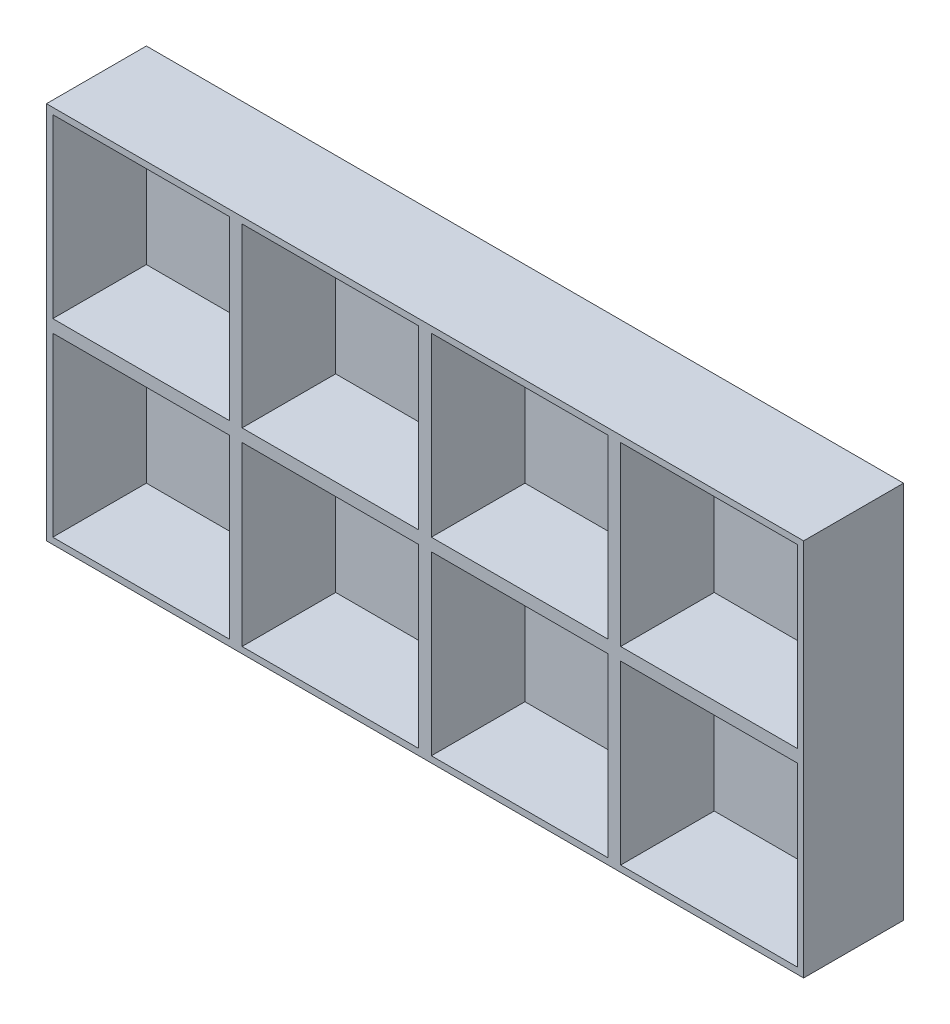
ISO-10303-21;
HEADER;
FILE_DESCRIPTION(('STEP AP214'),'2;1');
FILE_NAME('part.step','',(''),(''),'','','');
FILE_SCHEMA(('AUTOMOTIVE_DESIGN { 1 0 10303 214 1 1 1 1 }'));
ENDSEC;
DATA;
#1=APPLICATION_CONTEXT('core data for automotive mechanical design processes');
#2=APPLICATION_PROTOCOL_DEFINITION('international standard','automotive_design',2000,#1);
#3=PRODUCT_CONTEXT('',#1,'mechanical');
#4=PRODUCT('Part','Part','',(#3));
#5=PRODUCT_RELATED_PRODUCT_CATEGORY('part','',(#4));
#6=PRODUCT_DEFINITION_FORMATION('','',#4);
#7=PRODUCT_DEFINITION_CONTEXT('part definition',#1,'design');
#8=PRODUCT_DEFINITION('design','',#6,#7);
#9=PRODUCT_DEFINITION_SHAPE('','',#8);
#10=(LENGTH_UNIT() NAMED_UNIT(*) SI_UNIT(.MILLI.,.METRE.));
#11=(NAMED_UNIT(*) PLANE_ANGLE_UNIT() SI_UNIT($,.RADIAN.));
#12=(NAMED_UNIT(*) SI_UNIT($,.STERADIAN.) SOLID_ANGLE_UNIT());
#13=UNCERTAINTY_MEASURE_WITH_UNIT(LENGTH_MEASURE(1.E-05),#10,'distance_accuracy_value','');
#14=(GEOMETRIC_REPRESENTATION_CONTEXT(3) GLOBAL_UNCERTAINTY_ASSIGNED_CONTEXT((#13)) GLOBAL_UNIT_ASSIGNED_CONTEXT((#10,
#11,#12)) REPRESENTATION_CONTEXT('',''));
#15=CARTESIAN_POINT('',(0.,0.,0.));
#16=DIRECTION('',(0.,0.,1.));
#17=DIRECTION('',(1.,0.,0.));
#18=AXIS2_PLACEMENT_3D('',#15,#16,#17);
#19=CARTESIAN_POINT('',(0.,0.,14.8333333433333));
#20=DIRECTION('',(-1.,0.,0.));
#21=DIRECTION('',(0.,0.,1.));
#22=AXIS2_PLACEMENT_3D('',#19,#20,#21);
#23=PLANE('',#22);
#24=DIRECTION('',(0.,0.,-1.));
#25=VECTOR('',#24,1.);
#26=CARTESIAN_POINT('',(0.,30.,14.8333333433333));
#27=LINE('',#26,#25);
#28=CARTESIAN_POINT('',(0.,30.,14.8333333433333));
#29=VERTEX_POINT('',#28);
#30=CARTESIAN_POINT('',(0.,30.,-1.));
#31=VERTEX_POINT('',#30);
#32=EDGE_CURVE('E61',#29,#31,#27,.T.);
#33=ORIENTED_EDGE('',*,*,#32,.T.);
#34=DIRECTION('',(0.,1.,0.));
#35=VECTOR('',#34,1.);
#36=CARTESIAN_POINT('',(0.,30.,-1.));
#37=LINE('',#36,#35);
#38=CARTESIAN_POINT('',(0.,-30.,-1.));
#39=VERTEX_POINT('',#38);
#40=EDGE_CURVE('E982',#39,#31,#37,.T.);
#41=ORIENTED_EDGE('',*,*,#40,.F.);
#42=DIRECTION('',(0.,0.,-1.));
#43=VECTOR('',#42,1.);
#44=CARTESIAN_POINT('',(0.,-30.,14.8333333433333));
#45=LINE('',#44,#43);
#46=CARTESIAN_POINT('',(0.,-30.,14.8333333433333));
#47=VERTEX_POINT('',#46);
#48=EDGE_CURVE('E201',#47,#39,#45,.T.);
#49=ORIENTED_EDGE('',*,*,#48,.F.);
#50=DIRECTION('',(0.,1.,0.));
#51=VECTOR('',#50,1.);
#52=CARTESIAN_POINT('',(0.,0.,14.8333333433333));
#53=LINE('',#52,#51);
#54=EDGE_CURVE('E186',#47,#29,#53,.T.);
#55=ORIENTED_EDGE('',*,*,#54,.T.);
#56=EDGE_LOOP('',(#33,#41,#49,#55));
#57=FACE_BOUND('',#56,.T.);
#58=ADVANCED_FACE('F51',(#57),#23,.T.);
#59=CARTESIAN_POINT('',(120.,0.,14.8333333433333));
#60=DIRECTION('',(-1.,0.,0.));
#61=DIRECTION('',(0.,-1.,0.));
#62=AXIS2_PLACEMENT_3D('',#59,#60,#61);
#63=PLANE('',#62);
#64=DIRECTION('',(0.,0.,-1.));
#65=VECTOR('',#64,1.);
#66=CARTESIAN_POINT('',(120.,-30.,14.8333333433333));
#67=LINE('',#66,#65);
#68=CARTESIAN_POINT('',(120.,-30.,14.8333333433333));
#69=VERTEX_POINT('',#68);
#70=CARTESIAN_POINT('',(120.,-30.,-1.));
#71=VERTEX_POINT('',#70);
#72=EDGE_CURVE('E705',#69,#71,#67,.T.);
#73=ORIENTED_EDGE('',*,*,#72,.T.);
#74=DIRECTION('',(0.,-1.,0.));
#75=VECTOR('',#74,1.);
#76=CARTESIAN_POINT('',(120.,30.,-1.));
#77=LINE('',#76,#75);
#78=CARTESIAN_POINT('',(120.,30.,-1.));
#79=VERTEX_POINT('',#78);
#80=EDGE_CURVE('E983',#79,#71,#77,.T.);
#81=ORIENTED_EDGE('',*,*,#80,.F.);
#82=DIRECTION('',(0.,0.,-1.));
#83=VECTOR('',#82,1.);
#84=CARTESIAN_POINT('',(120.,30.,14.8333333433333));
#85=LINE('',#84,#83);
#86=CARTESIAN_POINT('',(120.,30.,14.8333333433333));
#87=VERTEX_POINT('',#86);
#88=EDGE_CURVE('E11',#87,#79,#85,.T.);
#89=ORIENTED_EDGE('',*,*,#88,.F.);
#90=DIRECTION('',(0.,1.,0.));
#91=VECTOR('',#90,1.);
#92=CARTESIAN_POINT('',(120.,0.,14.8333333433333));
#93=LINE('',#92,#91);
#94=EDGE_CURVE('E188',#69,#87,#93,.T.);
#95=ORIENTED_EDGE('',*,*,#94,.F.);
#96=EDGE_LOOP('',(#73,#81,#89,#95));
#97=FACE_BOUND('',#96,.T.);
#98=ADVANCED_FACE('F345',(#97),#63,.F.);
#99=CARTESIAN_POINT('',(0.,1.,14.8333333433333));
#100=DIRECTION('',(0.,1.,0.));
#101=DIRECTION('',(0.,0.,1.));
#102=AXIS2_PLACEMENT_3D('',#99,#100,#101);
#103=PLANE('',#102);
#104=DIRECTION('',(1.,0.,0.));
#105=VECTOR('',#104,1.);
#106=CARTESIAN_POINT('',(0.,1.,0.));
#107=LINE('',#106,#105);
#108=CARTESIAN_POINT('',(1.,1.,0.));
#109=VERTEX_POINT('',#108);
#110=CARTESIAN_POINT('',(29.,1.,0.));
#111=VERTEX_POINT('',#110);
#112=EDGE_CURVE('E232',#109,#111,#107,.T.);
#113=ORIENTED_EDGE('',*,*,#112,.F.);
#114=DIRECTION('',(0.,0.,-1.));
#115=VECTOR('',#114,1.);
#116=CARTESIAN_POINT('',(1.,1.,14.8333333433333));
#117=LINE('',#116,#115);
#118=CARTESIAN_POINT('',(1.,1.,14.8333333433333));
#119=VERTEX_POINT('',#118);
#120=EDGE_CURVE('E175',#119,#109,#117,.T.);
#121=ORIENTED_EDGE('',*,*,#120,.F.);
#122=DIRECTION('',(1.,0.,0.));
#123=VECTOR('',#122,1.);
#124=CARTESIAN_POINT('',(0.,1.,14.8333333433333));
#125=LINE('',#124,#123);
#126=CARTESIAN_POINT('',(29.,1.,14.8333333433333));
#127=VERTEX_POINT('',#126);
#128=EDGE_CURVE('E173',#119,#127,#125,.T.);
#129=ORIENTED_EDGE('',*,*,#128,.T.);
#130=DIRECTION('',(0.,0.,-1.));
#131=VECTOR('',#130,1.);
#132=CARTESIAN_POINT('',(29.,1.,14.8333333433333));
#133=LINE('',#132,#131);
#134=EDGE_CURVE('E108',#127,#111,#133,.T.);
#135=ORIENTED_EDGE('',*,*,#134,.T.);
#136=EDGE_LOOP('',(#113,#121,#129,#135));
#137=FACE_BOUND('',#136,.T.);
#138=ADVANCED_FACE('F174',(#137),#103,.T.);
#139=CARTESIAN_POINT('',(1.,0.,14.8333333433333));
#140=DIRECTION('',(1.,0.,0.));
#141=DIRECTION('',(0.,1.,0.));
#142=AXIS2_PLACEMENT_3D('',#139,#140,#141);
#143=PLANE('',#142);
#144=DIRECTION('',(0.,-1.,0.));
#145=VECTOR('',#144,1.);
#146=CARTESIAN_POINT('',(1.,0.,0.));
#147=LINE('',#146,#145);
#148=CARTESIAN_POINT('',(1.,29.,0.));
#149=VERTEX_POINT('',#148);
#150=EDGE_CURVE('E234',#149,#109,#147,.T.);
#151=ORIENTED_EDGE('',*,*,#150,.F.);
#152=DIRECTION('',(0.,0.,-1.));
#153=VECTOR('',#152,1.);
#154=CARTESIAN_POINT('',(1.,29.,14.8333333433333));
#155=LINE('',#154,#153);
#156=CARTESIAN_POINT('',(1.,29.,14.8333333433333));
#157=VERTEX_POINT('',#156);
#158=EDGE_CURVE('E100',#157,#149,#155,.T.);
#159=ORIENTED_EDGE('',*,*,#158,.F.);
#160=DIRECTION('',(0.,-1.,0.));
#161=VECTOR('',#160,1.);
#162=CARTESIAN_POINT('',(1.,0.,14.8333333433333));
#163=LINE('',#162,#161);
#164=EDGE_CURVE('E179',#157,#119,#163,.T.);
#165=ORIENTED_EDGE('',*,*,#164,.T.);
#166=ORIENTED_EDGE('',*,*,#120,.T.);
#167=EDGE_LOOP('',(#151,#159,#165,#166));
#168=FACE_BOUND('',#167,.T.);
#169=ADVANCED_FACE('F323',(#168),#143,.T.);
#170=CARTESIAN_POINT('',(0.,29.,14.8333333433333));
#171=DIRECTION('',(0.,-1.,0.));
#172=DIRECTION('',(1.,0.,0.));
#173=AXIS2_PLACEMENT_3D('',#170,#171,#172);
#174=PLANE('',#173);
#175=DIRECTION('',(-1.,0.,0.));
#176=VECTOR('',#175,1.);
#177=CARTESIAN_POINT('',(0.,29.,0.));
#178=LINE('',#177,#176);
#179=CARTESIAN_POINT('',(29.,29.,0.));
#180=VERTEX_POINT('',#179);
#181=EDGE_CURVE('E237',#180,#149,#178,.T.);
#182=ORIENTED_EDGE('',*,*,#181,.F.);
#183=DIRECTION('',(0.,0.,-1.));
#184=VECTOR('',#183,1.);
#185=CARTESIAN_POINT('',(29.,29.,14.8333333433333));
#186=LINE('',#185,#184);
#187=CARTESIAN_POINT('',(29.,29.,14.8333333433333));
#188=VERTEX_POINT('',#187);
#189=EDGE_CURVE('E169',#188,#180,#186,.T.);
#190=ORIENTED_EDGE('',*,*,#189,.F.);
#191=DIRECTION('',(-1.,0.,0.));
#192=VECTOR('',#191,1.);
#193=CARTESIAN_POINT('',(0.,29.,14.8333333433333));
#194=LINE('',#193,#192);
#195=EDGE_CURVE('E185',#188,#157,#194,.T.);
#196=ORIENTED_EDGE('',*,*,#195,.T.);
#197=ORIENTED_EDGE('',*,*,#158,.T.);
#198=EDGE_LOOP('',(#182,#190,#196,#197));
#199=FACE_BOUND('',#198,.T.);
#200=ADVANCED_FACE('F324',(#199),#174,.T.);
#201=CARTESIAN_POINT('',(0.,0.999999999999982,14.8333333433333));
#202=DIRECTION('',(0.,1.,0.));
#203=DIRECTION('',(-1.,0.,0.));
#204=AXIS2_PLACEMENT_3D('',#201,#202,#203);
#205=PLANE('',#204);
#206=DIRECTION('',(1.,0.,0.));
#207=VECTOR('',#206,1.);
#208=CARTESIAN_POINT('',(0.,0.999999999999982,0.));
#209=LINE('',#208,#207);
#210=CARTESIAN_POINT('',(91.,1.00000000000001,0.));
#211=VERTEX_POINT('',#210);
#212=CARTESIAN_POINT('',(119.,1.00000000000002,0.));
#213=VERTEX_POINT('',#212);
#214=EDGE_CURVE('E221',#211,#213,#209,.T.);
#215=ORIENTED_EDGE('',*,*,#214,.F.);
#216=DIRECTION('',(0.,0.,-1.));
#217=VECTOR('',#216,1.);
#218=CARTESIAN_POINT('',(91.,1.00000000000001,14.8333333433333));
#219=LINE('',#218,#217);
#220=CARTESIAN_POINT('',(91.,1.00000000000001,14.8333333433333));
#221=VERTEX_POINT('',#220);
#222=EDGE_CURVE('E170',#221,#211,#219,.T.);
#223=ORIENTED_EDGE('',*,*,#222,.F.);
#224=DIRECTION('',(1.,0.,0.));
#225=VECTOR('',#224,1.);
#226=CARTESIAN_POINT('',(0.,0.999999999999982,14.8333333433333));
#227=LINE('',#226,#225);
#228=CARTESIAN_POINT('',(119.,1.00000000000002,14.8333333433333));
#229=VERTEX_POINT('',#228);
#230=EDGE_CURVE('E313',#221,#229,#227,.T.);
#231=ORIENTED_EDGE('',*,*,#230,.T.);
#232=DIRECTION('',(0.,0.,-1.));
#233=VECTOR('',#232,1.);
#234=CARTESIAN_POINT('',(119.,1.00000000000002,14.8333333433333));
#235=LINE('',#234,#233);
#236=EDGE_CURVE('E246',#229,#213,#235,.T.);
#237=ORIENTED_EDGE('',*,*,#236,.T.);
#238=EDGE_LOOP('',(#215,#223,#231,#237));
#239=FACE_BOUND('',#238,.T.);
#240=ADVANCED_FACE('F361',(#239),#205,.T.);
#241=CARTESIAN_POINT('',(91.,0.,14.8333333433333));
#242=DIRECTION('',(-1.,0.,0.));
#243=DIRECTION('',(0.,0.,1.));
#244=AXIS2_PLACEMENT_3D('',#241,#242,#243);
#245=PLANE('',#244);
#246=DIRECTION('',(0.,1.,0.));
#247=VECTOR('',#246,1.);
#248=CARTESIAN_POINT('',(91.,0.,0.));
#249=LINE('',#248,#247);
#250=CARTESIAN_POINT('',(91.,29.,0.));
#251=VERTEX_POINT('',#250);
#252=EDGE_CURVE('E223',#211,#251,#249,.T.);
#253=ORIENTED_EDGE('',*,*,#252,.T.);
#254=DIRECTION('',(0.,0.,-1.));
#255=VECTOR('',#254,1.);
#256=CARTESIAN_POINT('',(91.,29.,14.8333333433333));
#257=LINE('',#256,#255);
#258=CARTESIAN_POINT('',(91.,29.,14.8333333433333));
#259=VERTEX_POINT('',#258);
#260=EDGE_CURVE('E253',#259,#251,#257,.T.);
#261=ORIENTED_EDGE('',*,*,#260,.F.);
#262=DIRECTION('',(0.,1.,0.));
#263=VECTOR('',#262,1.);
#264=CARTESIAN_POINT('',(91.,0.,14.8333333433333));
#265=LINE('',#264,#263);
#266=EDGE_CURVE('E316',#221,#259,#265,.T.);
#267=ORIENTED_EDGE('',*,*,#266,.F.);
#268=ORIENTED_EDGE('',*,*,#222,.T.);
#269=EDGE_LOOP('',(#253,#261,#267,#268));
#270=FACE_BOUND('',#269,.T.);
#271=ADVANCED_FACE('F374',(#270),#245,.F.);
#272=CARTESIAN_POINT('',(0.,29.,14.8333333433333));
#273=DIRECTION('',(0.,1.,0.));
#274=DIRECTION('',(-1.,0.,0.));
#275=AXIS2_PLACEMENT_3D('',#272,#273,#274);
#276=PLANE('',#275);
#277=DIRECTION('',(1.,0.,0.));
#278=VECTOR('',#277,1.);
#279=CARTESIAN_POINT('',(0.,29.,0.));
#280=LINE('',#279,#278);
#281=CARTESIAN_POINT('',(119.,29.,0.));
#282=VERTEX_POINT('',#281);
#283=EDGE_CURVE('E226',#251,#282,#280,.T.);
#284=ORIENTED_EDGE('',*,*,#283,.T.);
#285=DIRECTION('',(0.,0.,-1.));
#286=VECTOR('',#285,1.);
#287=CARTESIAN_POINT('',(119.,29.,14.8333333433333));
#288=LINE('',#287,#286);
#289=CARTESIAN_POINT('',(119.,29.,14.8333333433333));
#290=VERTEX_POINT('',#289);
#291=EDGE_CURVE('E249',#290,#282,#288,.T.);
#292=ORIENTED_EDGE('',*,*,#291,.F.);
#293=DIRECTION('',(1.,0.,0.));
#294=VECTOR('',#293,1.);
#295=CARTESIAN_POINT('',(0.,29.,14.8333333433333));
#296=LINE('',#295,#294);
#297=EDGE_CURVE('E319',#259,#290,#296,.T.);
#298=ORIENTED_EDGE('',*,*,#297,.F.);
#299=ORIENTED_EDGE('',*,*,#260,.T.);
#300=EDGE_LOOP('',(#284,#292,#298,#299));
#301=FACE_BOUND('',#300,.T.);
#302=ADVANCED_FACE('F370',(#301),#276,.F.);
#303=CARTESIAN_POINT('',(0.,0.999999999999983,14.8333333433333));
#304=DIRECTION('',(0.,1.,0.));
#305=DIRECTION('',(-1.,0.,0.));
#306=AXIS2_PLACEMENT_3D('',#303,#304,#305);
#307=PLANE('',#306);
#308=DIRECTION('',(1.,0.,0.));
#309=VECTOR('',#308,1.);
#310=CARTESIAN_POINT('',(0.,0.999999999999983,0.));
#311=LINE('',#310,#309);
#312=CARTESIAN_POINT('',(61.,1.,0.));
#313=VERTEX_POINT('',#312);
#314=CARTESIAN_POINT('',(89.,1.00000000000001,0.));
#315=VERTEX_POINT('',#314);
#316=EDGE_CURVE('E210',#313,#315,#311,.T.);
#317=ORIENTED_EDGE('',*,*,#316,.F.);
#318=DIRECTION('',(0.,0.,-1.));
#319=VECTOR('',#318,1.);
#320=CARTESIAN_POINT('',(61.,1.,14.8333333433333));
#321=LINE('',#320,#319);
#322=CARTESIAN_POINT('',(61.,1.,14.8333333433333));
#323=VERTEX_POINT('',#322);
#324=EDGE_CURVE('E250',#323,#313,#321,.T.);
#325=ORIENTED_EDGE('',*,*,#324,.F.);
#326=DIRECTION('',(1.,0.,0.));
#327=VECTOR('',#326,1.);
#328=CARTESIAN_POINT('',(0.,0.999999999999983,14.8333333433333));
#329=LINE('',#328,#327);
#330=CARTESIAN_POINT('',(89.,1.00000000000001,14.8333333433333));
#331=VERTEX_POINT('',#330);
#332=EDGE_CURVE('E297',#323,#331,#329,.T.);
#333=ORIENTED_EDGE('',*,*,#332,.T.);
#334=DIRECTION('',(0.,0.,-1.));
#335=VECTOR('',#334,1.);
#336=CARTESIAN_POINT('',(89.,1.00000000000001,14.8333333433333));
#337=LINE('',#336,#335);
#338=EDGE_CURVE('E258',#331,#315,#337,.T.);
#339=ORIENTED_EDGE('',*,*,#338,.T.);
#340=EDGE_LOOP('',(#317,#325,#333,#339));
#341=FACE_BOUND('',#340,.T.);
#342=ADVANCED_FACE('F373',(#341),#307,.T.);
#343=CARTESIAN_POINT('',(61.,0.,14.8333333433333));
#344=DIRECTION('',(-1.,0.,0.));
#345=DIRECTION('',(0.,-1.,0.));
#346=AXIS2_PLACEMENT_3D('',#343,#344,#345);
#347=PLANE('',#346);
#348=DIRECTION('',(0.,1.,0.));
#349=VECTOR('',#348,1.);
#350=CARTESIAN_POINT('',(61.,0.,0.));
#351=LINE('',#350,#349);
#352=CARTESIAN_POINT('',(61.,29.,0.));
#353=VERTEX_POINT('',#352);
#354=EDGE_CURVE('E212',#313,#353,#351,.T.);
#355=ORIENTED_EDGE('',*,*,#354,.T.);
#356=DIRECTION('',(0.,0.,-1.));
#357=VECTOR('',#356,1.);
#358=CARTESIAN_POINT('',(61.,29.,14.8333333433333));
#359=LINE('',#358,#357);
#360=CARTESIAN_POINT('',(61.,29.,14.8333333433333));
#361=VERTEX_POINT('',#360);
#362=EDGE_CURVE('E264',#361,#353,#359,.T.);
#363=ORIENTED_EDGE('',*,*,#362,.F.);
#364=DIRECTION('',(0.,1.,0.));
#365=VECTOR('',#364,1.);
#366=CARTESIAN_POINT('',(61.,0.,14.8333333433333));
#367=LINE('',#366,#365);
#368=EDGE_CURVE('E301',#323,#361,#367,.T.);
#369=ORIENTED_EDGE('',*,*,#368,.F.);
#370=ORIENTED_EDGE('',*,*,#324,.T.);
#371=EDGE_LOOP('',(#355,#363,#369,#370));
#372=FACE_BOUND('',#371,.T.);
#373=ADVANCED_FACE('F388',(#372),#347,.F.);
#374=CARTESIAN_POINT('',(0.,29.,14.8333333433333));
#375=DIRECTION('',(0.,1.,0.));
#376=DIRECTION('',(0.,0.,1.));
#377=AXIS2_PLACEMENT_3D('',#374,#375,#376);
#378=PLANE('',#377);
#379=DIRECTION('',(1.,0.,0.));
#380=VECTOR('',#379,1.);
#381=CARTESIAN_POINT('',(0.,29.,0.));
#382=LINE('',#381,#380);
#383=CARTESIAN_POINT('',(89.,29.,0.));
#384=VERTEX_POINT('',#383);
#385=EDGE_CURVE('E215',#353,#384,#382,.T.);
#386=ORIENTED_EDGE('',*,*,#385,.T.);
#387=DIRECTION('',(0.,0.,-1.));
#388=VECTOR('',#387,1.);
#389=CARTESIAN_POINT('',(89.,29.,14.8333333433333));
#390=LINE('',#389,#388);
#391=CARTESIAN_POINT('',(89.,29.,14.8333333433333));
#392=VERTEX_POINT('',#391);
#393=EDGE_CURVE('E261',#392,#384,#390,.T.);
#394=ORIENTED_EDGE('',*,*,#393,.F.);
#395=DIRECTION('',(1.,0.,0.));
#396=VECTOR('',#395,1.);
#397=CARTESIAN_POINT('',(0.,29.,14.8333333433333));
#398=LINE('',#397,#396);
#399=EDGE_CURVE('E308',#361,#392,#398,.T.);
#400=ORIENTED_EDGE('',*,*,#399,.F.);
#401=ORIENTED_EDGE('',*,*,#362,.T.);
#402=EDGE_LOOP('',(#386,#394,#400,#401));
#403=FACE_BOUND('',#402,.T.);
#404=ADVANCED_FACE('F385',(#403),#378,.F.);
#405=CARTESIAN_POINT('',(0.,1.,14.8333333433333));
#406=DIRECTION('',(0.,1.,0.));
#407=DIRECTION('',(-1.,0.,0.));
#408=AXIS2_PLACEMENT_3D('',#405,#406,#407);
#409=PLANE('',#408);
#410=DIRECTION('',(1.,0.,0.));
#411=VECTOR('',#410,1.);
#412=CARTESIAN_POINT('',(0.,1.,0.));
#413=LINE('',#412,#411);
#414=CARTESIAN_POINT('',(31.,1.,0.));
#415=VERTEX_POINT('',#414);
#416=CARTESIAN_POINT('',(59.,1.,0.));
#417=VERTEX_POINT('',#416);
#418=EDGE_CURVE('E197',#415,#417,#413,.T.);
#419=ORIENTED_EDGE('',*,*,#418,.F.);
#420=DIRECTION('',(0.,0.,-1.));
#421=VECTOR('',#420,1.);
#422=CARTESIAN_POINT('',(31.,1.,14.8333333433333));
#423=LINE('',#422,#421);
#424=CARTESIAN_POINT('',(31.,1.,14.8333333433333));
#425=VERTEX_POINT('',#424);
#426=EDGE_CURVE('E55',#425,#415,#423,.T.);
#427=ORIENTED_EDGE('',*,*,#426,.F.);
#428=DIRECTION('',(1.,0.,0.));
#429=VECTOR('',#428,1.);
#430=CARTESIAN_POINT('',(0.,1.,14.8333333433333));
#431=LINE('',#430,#429);
#432=CARTESIAN_POINT('',(59.,1.,14.8333333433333));
#433=VERTEX_POINT('',#432);
#434=EDGE_CURVE('E241',#425,#433,#431,.T.);
#435=ORIENTED_EDGE('',*,*,#434,.T.);
#436=DIRECTION('',(0.,0.,-1.));
#437=VECTOR('',#436,1.);
#438=CARTESIAN_POINT('',(59.,1.,14.8333333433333));
#439=LINE('',#438,#437);
#440=EDGE_CURVE('E196',#433,#417,#439,.T.);
#441=ORIENTED_EDGE('',*,*,#440,.T.);
#442=EDGE_LOOP('',(#419,#427,#435,#441));
#443=FACE_BOUND('',#442,.T.);
#444=ADVANCED_FACE('F53',(#443),#409,.T.);
#445=CARTESIAN_POINT('',(31.,0.,14.8333333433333));
#446=DIRECTION('',(1.,0.,0.));
#447=DIRECTION('',(0.,1.,0.));
#448=AXIS2_PLACEMENT_3D('',#445,#446,#447);
#449=PLANE('',#448);
#450=DIRECTION('',(0.,-1.,0.));
#451=VECTOR('',#450,1.);
#452=CARTESIAN_POINT('',(31.,0.,0.));
#453=LINE('',#452,#451);
#454=CARTESIAN_POINT('',(31.,29.,0.));
#455=VERTEX_POINT('',#454);
#456=EDGE_CURVE('E200',#455,#415,#453,.T.);
#457=ORIENTED_EDGE('',*,*,#456,.F.);
#458=DIRECTION('',(0.,0.,-1.));
#459=VECTOR('',#458,1.);
#460=CARTESIAN_POINT('',(31.,29.,14.8333333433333));
#461=LINE('',#460,#459);
#462=CARTESIAN_POINT('',(31.,29.,14.8333333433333));
#463=VERTEX_POINT('',#462);
#464=EDGE_CURVE('E272',#463,#455,#461,.T.);
#465=ORIENTED_EDGE('',*,*,#464,.F.);
#466=DIRECTION('',(0.,-1.,0.));
#467=VECTOR('',#466,1.);
#468=CARTESIAN_POINT('',(31.,0.,14.8333333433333));
#469=LINE('',#468,#467);
#470=EDGE_CURVE('E281',#463,#425,#469,.T.);
#471=ORIENTED_EDGE('',*,*,#470,.T.);
#472=ORIENTED_EDGE('',*,*,#426,.T.);
#473=EDGE_LOOP('',(#457,#465,#471,#472));
#474=FACE_BOUND('',#473,.T.);
#475=ADVANCED_FACE('F279',(#474),#449,.T.);
#476=CARTESIAN_POINT('',(0.,29.,14.8333333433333));
#477=DIRECTION('',(0.,-1.,0.));
#478=DIRECTION('',(1.,0.,0.));
#479=AXIS2_PLACEMENT_3D('',#476,#477,#478);
#480=PLANE('',#479);
#481=DIRECTION('',(-1.,0.,0.));
#482=VECTOR('',#481,1.);
#483=CARTESIAN_POINT('',(0.,29.,0.));
#484=LINE('',#483,#482);
#485=CARTESIAN_POINT('',(59.,29.,0.));
#486=VERTEX_POINT('',#485);
#487=EDGE_CURVE('E204',#486,#455,#484,.T.);
#488=ORIENTED_EDGE('',*,*,#487,.F.);
#489=DIRECTION('',(0.,0.,-1.));
#490=VECTOR('',#489,1.);
#491=CARTESIAN_POINT('',(59.,29.,14.8333333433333));
#492=LINE('',#491,#490);
#493=CARTESIAN_POINT('',(59.,29.,14.8333333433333));
#494=VERTEX_POINT('',#493);
#495=EDGE_CURVE('E270',#494,#486,#492,.T.);
#496=ORIENTED_EDGE('',*,*,#495,.F.);
#497=DIRECTION('',(-1.,0.,0.));
#498=VECTOR('',#497,1.);
#499=CARTESIAN_POINT('',(0.,29.,14.8333333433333));
#500=LINE('',#499,#498);
#501=EDGE_CURVE('E298',#494,#463,#500,.T.);
#502=ORIENTED_EDGE('',*,*,#501,.T.);
#503=ORIENTED_EDGE('',*,*,#464,.T.);
#504=EDGE_LOOP('',(#488,#496,#502,#503));
#505=FACE_BOUND('',#504,.T.);
#506=ADVANCED_FACE('F286',(#505),#480,.T.);
#507=CARTESIAN_POINT('',(29.,0.,14.8333333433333));
#508=DIRECTION('',(-1.,0.,0.));
#509=DIRECTION('',(0.,0.,1.));
#510=AXIS2_PLACEMENT_3D('',#507,#508,#509);
#511=PLANE('',#510);
#512=DIRECTION('',(0.,1.,0.));
#513=VECTOR('',#512,1.);
#514=CARTESIAN_POINT('',(29.,0.,0.));
#515=LINE('',#514,#513);
#516=EDGE_CURVE('E167',#111,#180,#515,.T.);
#517=ORIENTED_EDGE('',*,*,#516,.F.);
#518=ORIENTED_EDGE('',*,*,#134,.F.);
#519=DIRECTION('',(0.,1.,0.));
#520=VECTOR('',#519,1.);
#521=CARTESIAN_POINT('',(29.,0.,14.8333333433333));
#522=LINE('',#521,#520);
#523=EDGE_CURVE('E165',#127,#188,#522,.T.);
#524=ORIENTED_EDGE('',*,*,#523,.T.);
#525=ORIENTED_EDGE('',*,*,#189,.T.);
#526=EDGE_LOOP('',(#517,#518,#524,#525));
#527=FACE_BOUND('',#526,.T.);
#528=ADVANCED_FACE('F162',(#527),#511,.T.);
#529=CARTESIAN_POINT('',(119.,0.,14.8333333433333));
#530=DIRECTION('',(1.,0.,0.));
#531=DIRECTION('',(0.,1.,0.));
#532=AXIS2_PLACEMENT_3D('',#529,#530,#531);
#533=PLANE('',#532);
#534=DIRECTION('',(0.,-1.,0.));
#535=VECTOR('',#534,1.);
#536=CARTESIAN_POINT('',(119.,0.,0.));
#537=LINE('',#536,#535);
#538=EDGE_CURVE('E229',#282,#213,#537,.T.);
#539=ORIENTED_EDGE('',*,*,#538,.T.);
#540=ORIENTED_EDGE('',*,*,#236,.F.);
#541=DIRECTION('',(0.,-1.,0.));
#542=VECTOR('',#541,1.);
#543=CARTESIAN_POINT('',(119.,0.,14.8333333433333));
#544=LINE('',#543,#542);
#545=EDGE_CURVE('E180',#290,#229,#544,.T.);
#546=ORIENTED_EDGE('',*,*,#545,.F.);
#547=ORIENTED_EDGE('',*,*,#291,.T.);
#548=EDGE_LOOP('',(#539,#540,#546,#547));
#549=FACE_BOUND('',#548,.T.);
#550=ADVANCED_FACE('F358',(#549),#533,.F.);
#551=CARTESIAN_POINT('',(89.,0.,14.8333333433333));
#552=DIRECTION('',(1.,0.,0.));
#553=DIRECTION('',(0.,0.,-1.));
#554=AXIS2_PLACEMENT_3D('',#551,#552,#553);
#555=PLANE('',#554);
#556=DIRECTION('',(0.,-1.,0.));
#557=VECTOR('',#556,1.);
#558=CARTESIAN_POINT('',(89.,0.,0.));
#559=LINE('',#558,#557);
#560=EDGE_CURVE('E218',#384,#315,#559,.T.);
#561=ORIENTED_EDGE('',*,*,#560,.T.);
#562=ORIENTED_EDGE('',*,*,#338,.F.);
#563=DIRECTION('',(0.,-1.,0.));
#564=VECTOR('',#563,1.);
#565=CARTESIAN_POINT('',(89.,0.,14.8333333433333));
#566=LINE('',#565,#564);
#567=EDGE_CURVE('E311',#392,#331,#566,.T.);
#568=ORIENTED_EDGE('',*,*,#567,.F.);
#569=ORIENTED_EDGE('',*,*,#393,.T.);
#570=EDGE_LOOP('',(#561,#562,#568,#569));
#571=FACE_BOUND('',#570,.T.);
#572=ADVANCED_FACE('F368',(#571),#555,.F.);
#573=CARTESIAN_POINT('',(59.,0.,14.8333333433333));
#574=DIRECTION('',(-1.,0.,0.));
#575=DIRECTION('',(0.,0.,1.));
#576=AXIS2_PLACEMENT_3D('',#573,#574,#575);
#577=PLANE('',#576);
#578=DIRECTION('',(0.,1.,0.));
#579=VECTOR('',#578,1.);
#580=CARTESIAN_POINT('',(59.,0.,0.));
#581=LINE('',#580,#579);
#582=EDGE_CURVE('E207',#417,#486,#581,.T.);
#583=ORIENTED_EDGE('',*,*,#582,.F.);
#584=ORIENTED_EDGE('',*,*,#440,.F.);
#585=DIRECTION('',(0.,1.,0.));
#586=VECTOR('',#585,1.);
#587=CARTESIAN_POINT('',(59.,0.,14.8333333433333));
#588=LINE('',#587,#586);
#589=EDGE_CURVE('E295',#433,#494,#588,.T.);
#590=ORIENTED_EDGE('',*,*,#589,.T.);
#591=ORIENTED_EDGE('',*,*,#495,.T.);
#592=EDGE_LOOP('',(#583,#584,#590,#591));
#593=FACE_BOUND('',#592,.T.);
#594=ADVANCED_FACE('F293',(#593),#577,.T.);
#595=CARTESIAN_POINT('',(0.,30.,14.8333333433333));
#596=DIRECTION('',(0.,1.,0.));
#597=DIRECTION('',(-1.,0.,0.));
#598=AXIS2_PLACEMENT_3D('',#595,#596,#597);
#599=PLANE('',#598);
#600=ORIENTED_EDGE('',*,*,#88,.T.);
#601=DIRECTION('',(1.,0.,0.));
#602=VECTOR('',#601,1.);
#603=CARTESIAN_POINT('',(120.,30.,-1.));
#604=LINE('',#603,#602);
#605=EDGE_CURVE('E985',#31,#79,#604,.T.);
#606=ORIENTED_EDGE('',*,*,#605,.F.);
#607=ORIENTED_EDGE('',*,*,#32,.F.);
#608=DIRECTION('',(1.,0.,0.));
#609=VECTOR('',#608,1.);
#610=CARTESIAN_POINT('',(0.,30.,14.8333333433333));
#611=LINE('',#610,#609);
#612=EDGE_CURVE('E194',#29,#87,#611,.T.);
#613=ORIENTED_EDGE('',*,*,#612,.T.);
#614=EDGE_LOOP('',(#600,#606,#607,#613));
#615=FACE_BOUND('',#614,.T.);
#616=ADVANCED_FACE('F398',(#615),#599,.T.);
#617=CARTESIAN_POINT('',(0.,0.,14.8333333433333));
#618=DIRECTION('',(0.,0.,1.));
#619=DIRECTION('',(1.,0.,0.));
#620=AXIS2_PLACEMENT_3D('',#617,#618,#619);
#621=PLANE('',#620);
#622=ORIENTED_EDGE('',*,*,#434,.F.);
#623=ORIENTED_EDGE('',*,*,#470,.F.);
#624=ORIENTED_EDGE('',*,*,#501,.F.);
#625=ORIENTED_EDGE('',*,*,#589,.F.);
#626=EDGE_LOOP('',(#622,#623,#624,#625));
#627=FACE_BOUND('',#626,.T.);
#628=ORIENTED_EDGE('',*,*,#332,.F.);
#629=ORIENTED_EDGE('',*,*,#368,.T.);
#630=ORIENTED_EDGE('',*,*,#399,.T.);
#631=ORIENTED_EDGE('',*,*,#567,.T.);
#632=EDGE_LOOP('',(#628,#629,#630,#631));
#633=FACE_BOUND('',#632,.T.);
#634=ORIENTED_EDGE('',*,*,#230,.F.);
#635=ORIENTED_EDGE('',*,*,#266,.T.);
#636=ORIENTED_EDGE('',*,*,#297,.T.);
#637=ORIENTED_EDGE('',*,*,#545,.T.);
#638=EDGE_LOOP('',(#634,#635,#636,#637));
#639=FACE_BOUND('',#638,.T.);
#640=ORIENTED_EDGE('',*,*,#128,.F.);
#641=ORIENTED_EDGE('',*,*,#164,.F.);
#642=ORIENTED_EDGE('',*,*,#195,.F.);
#643=ORIENTED_EDGE('',*,*,#523,.F.);
#644=EDGE_LOOP('',(#640,#641,#642,#643));
#645=FACE_BOUND('',#644,.T.);
#646=ORIENTED_EDGE('',*,*,#54,.F.);
#647=DIRECTION('',(1.,0.,0.));
#648=VECTOR('',#647,1.);
#649=CARTESIAN_POINT('',(0.,-30.,14.8333333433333));
#650=LINE('',#649,#648);
#651=EDGE_CURVE('E725',#47,#69,#650,.T.);
#652=ORIENTED_EDGE('',*,*,#651,.T.);
#653=ORIENTED_EDGE('',*,*,#94,.T.);
#654=ORIENTED_EDGE('',*,*,#612,.F.);
#655=EDGE_LOOP('',(#646,#652,#653,#654));
#656=FACE_BOUND('',#655,.T.);
#657=DIRECTION('',(1.,0.,0.));
#658=VECTOR('',#657,1.);
#659=CARTESIAN_POINT('',(0.,-1.,14.8333333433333));
#660=LINE('',#659,#658);
#661=CARTESIAN_POINT('',(31.,-0.999999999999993,14.8333333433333));
#662=VERTEX_POINT('',#661);
#663=CARTESIAN_POINT('',(59.,-0.999999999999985,14.8333333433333));
#664=VERTEX_POINT('',#663);
#665=EDGE_CURVE('E687',#662,#664,#660,.T.);
#666=ORIENTED_EDGE('',*,*,#665,.T.);
#667=DIRECTION('',(0.,-1.,0.));
#668=VECTOR('',#667,1.);
#669=CARTESIAN_POINT('',(59.,0.,14.8333333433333));
#670=LINE('',#669,#668);
#671=CARTESIAN_POINT('',(59.,-29.,14.8333333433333));
#672=VERTEX_POINT('',#671);
#673=EDGE_CURVE('E993',#664,#672,#670,.T.);
#674=ORIENTED_EDGE('',*,*,#673,.T.);
#675=DIRECTION('',(-1.,0.,0.));
#676=VECTOR('',#675,1.);
#677=CARTESIAN_POINT('',(0.,-29.,14.8333333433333));
#678=LINE('',#677,#676);
#679=CARTESIAN_POINT('',(31.,-29.,14.8333333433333));
#680=VERTEX_POINT('',#679);
#681=EDGE_CURVE('E995',#672,#680,#678,.T.);
#682=ORIENTED_EDGE('',*,*,#681,.T.);
#683=DIRECTION('',(0.,1.,0.));
#684=VECTOR('',#683,1.);
#685=CARTESIAN_POINT('',(31.,0.,14.8333333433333));
#686=LINE('',#685,#684);
#687=EDGE_CURVE('E997',#680,#662,#686,.T.);
#688=ORIENTED_EDGE('',*,*,#687,.T.);
#689=EDGE_LOOP('',(#666,#674,#682,#688));
#690=FACE_BOUND('',#689,.T.);
#691=DIRECTION('',(1.,0.,0.));
#692=VECTOR('',#691,1.);
#693=CARTESIAN_POINT('',(0.,-0.999999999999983,14.8333333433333));
#694=LINE('',#693,#692);
#695=CARTESIAN_POINT('',(61.,-0.999999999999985,14.8333333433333));
#696=VERTEX_POINT('',#695);
#697=CARTESIAN_POINT('',(89.,-0.999999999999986,14.8333333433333));
#698=VERTEX_POINT('',#697);
#699=EDGE_CURVE('E999',#696,#698,#694,.T.);
#700=ORIENTED_EDGE('',*,*,#699,.T.);
#701=DIRECTION('',(0.,1.,0.));
#702=VECTOR('',#701,1.);
#703=CARTESIAN_POINT('',(89.,0.,14.8333333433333));
#704=LINE('',#703,#702);
#705=CARTESIAN_POINT('',(89.,-29.,14.8333333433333));
#706=VERTEX_POINT('',#705);
#707=EDGE_CURVE('E1001',#706,#698,#704,.T.);
#708=ORIENTED_EDGE('',*,*,#707,.F.);
#709=DIRECTION('',(1.,0.,0.));
#710=VECTOR('',#709,1.);
#711=CARTESIAN_POINT('',(0.,-29.,14.8333333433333));
#712=LINE('',#711,#710);
#713=CARTESIAN_POINT('',(61.,-29.,14.8333333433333));
#714=VERTEX_POINT('',#713);
#715=EDGE_CURVE('E1004',#714,#706,#712,.T.);
#716=ORIENTED_EDGE('',*,*,#715,.F.);
#717=DIRECTION('',(0.,-1.,0.));
#718=VECTOR('',#717,1.);
#719=CARTESIAN_POINT('',(61.,0.,14.8333333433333));
#720=LINE('',#719,#718);
#721=EDGE_CURVE('E1007',#696,#714,#720,.T.);
#722=ORIENTED_EDGE('',*,*,#721,.F.);
#723=EDGE_LOOP('',(#700,#708,#716,#722));
#724=FACE_BOUND('',#723,.T.);
#725=DIRECTION('',(1.,0.,0.));
#726=VECTOR('',#725,1.);
#727=CARTESIAN_POINT('',(0.,-0.999999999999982,14.8333333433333));
#728=LINE('',#727,#726);
#729=CARTESIAN_POINT('',(91.,-0.999999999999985,14.8333333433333));
#730=VERTEX_POINT('',#729);
#731=CARTESIAN_POINT('',(119.,-0.999999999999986,14.8333333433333));
#732=VERTEX_POINT('',#731);
#733=EDGE_CURVE('E1010',#730,#732,#728,.T.);
#734=ORIENTED_EDGE('',*,*,#733,.T.);
#735=DIRECTION('',(0.,1.,0.));
#736=VECTOR('',#735,1.);
#737=CARTESIAN_POINT('',(119.,0.,14.8333333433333));
#738=LINE('',#737,#736);
#739=CARTESIAN_POINT('',(119.,-29.,14.8333333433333));
#740=VERTEX_POINT('',#739);
#741=EDGE_CURVE('E1012',#740,#732,#738,.T.);
#742=ORIENTED_EDGE('',*,*,#741,.F.);
#743=DIRECTION('',(1.,0.,0.));
#744=VECTOR('',#743,1.);
#745=CARTESIAN_POINT('',(0.,-29.,14.8333333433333));
#746=LINE('',#745,#744);
#747=CARTESIAN_POINT('',(91.,-29.,14.8333333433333));
#748=VERTEX_POINT('',#747);
#749=EDGE_CURVE('E1015',#748,#740,#746,.T.);
#750=ORIENTED_EDGE('',*,*,#749,.F.);
#751=DIRECTION('',(0.,-1.,0.));
#752=VECTOR('',#751,1.);
#753=CARTESIAN_POINT('',(91.,0.,14.8333333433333));
#754=LINE('',#753,#752);
#755=EDGE_CURVE('E1018',#730,#748,#754,.T.);
#756=ORIENTED_EDGE('',*,*,#755,.F.);
#757=EDGE_LOOP('',(#734,#742,#750,#756));
#758=FACE_BOUND('',#757,.T.);
#759=DIRECTION('',(1.,0.,0.));
#760=VECTOR('',#759,1.);
#761=CARTESIAN_POINT('',(0.,-1.,14.8333333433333));
#762=LINE('',#761,#760);
#763=CARTESIAN_POINT('',(1.,-1.,14.8333333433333));
#764=VERTEX_POINT('',#763);
#765=CARTESIAN_POINT('',(29.,-0.999999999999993,14.8333333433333));
#766=VERTEX_POINT('',#765);
#767=EDGE_CURVE('E691',#764,#766,#762,.T.);
#768=ORIENTED_EDGE('',*,*,#767,.T.);
#769=DIRECTION('',(0.,-1.,0.));
#770=VECTOR('',#769,1.);
#771=CARTESIAN_POINT('',(29.,0.,14.8333333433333));
#772=LINE('',#771,#770);
#773=CARTESIAN_POINT('',(29.,-29.,14.8333333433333));
#774=VERTEX_POINT('',#773);
#775=EDGE_CURVE('E1022',#766,#774,#772,.T.);
#776=ORIENTED_EDGE('',*,*,#775,.T.);
#777=DIRECTION('',(-1.,0.,0.));
#778=VECTOR('',#777,1.);
#779=CARTESIAN_POINT('',(0.,-29.,14.8333333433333));
#780=LINE('',#779,#778);
#781=CARTESIAN_POINT('',(1.00000000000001,-29.,14.8333333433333));
#782=VERTEX_POINT('',#781);
#783=EDGE_CURVE('E1024',#774,#782,#780,.T.);
#784=ORIENTED_EDGE('',*,*,#783,.T.);
#785=DIRECTION('',(0.,1.,0.));
#786=VECTOR('',#785,1.);
#787=CARTESIAN_POINT('',(1.,0.,14.8333333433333));
#788=LINE('',#787,#786);
#789=EDGE_CURVE('E1026',#782,#764,#788,.T.);
#790=ORIENTED_EDGE('',*,*,#789,.T.);
#791=EDGE_LOOP('',(#768,#776,#784,#790));
#792=FACE_BOUND('',#791,.T.);
#793=ADVANCED_FACE('F183',(#627,#633,#639,#645,#656,#690,#724,#758,#792),#621,.T.);
#794=CARTESIAN_POINT('',(0.,-30.,14.8333333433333));
#795=DIRECTION('',(0.,1.,0.));
#796=DIRECTION('',(-1.,0.,0.));
#797=AXIS2_PLACEMENT_3D('',#794,#795,#796);
#798=PLANE('',#797);
#799=ORIENTED_EDGE('',*,*,#48,.T.);
#800=DIRECTION('',(-1.,0.,0.));
#801=VECTOR('',#800,1.);
#802=CARTESIAN_POINT('',(120.,-30.,-1.));
#803=LINE('',#802,#801);
#804=EDGE_CURVE('E974',#71,#39,#803,.T.);
#805=ORIENTED_EDGE('',*,*,#804,.F.);
#806=ORIENTED_EDGE('',*,*,#72,.F.);
#807=ORIENTED_EDGE('',*,*,#651,.F.);
#808=EDGE_LOOP('',(#799,#805,#806,#807));
#809=FACE_BOUND('',#808,.T.);
#810=ADVANCED_FACE('F480',(#809),#798,.F.);
#811=CARTESIAN_POINT('',(0.,-1.,14.8333333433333));
#812=DIRECTION('',(0.,1.,0.));
#813=DIRECTION('',(-1.,0.,0.));
#814=AXIS2_PLACEMENT_3D('',#811,#812,#813);
#815=PLANE('',#814);
#816=DIRECTION('',(1.,0.,0.));
#817=VECTOR('',#816,1.);
#818=CARTESIAN_POINT('',(0.,-1.,0.));
#819=LINE('',#818,#817);
#820=CARTESIAN_POINT('',(1.,-1.,0.));
#821=VERTEX_POINT('',#820);
#822=CARTESIAN_POINT('',(29.,-0.999999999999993,0.));
#823=VERTEX_POINT('',#822);
#824=EDGE_CURVE('E664',#821,#823,#819,.T.);
#825=ORIENTED_EDGE('',*,*,#824,.T.);
#826=DIRECTION('',(0.,0.,-1.));
#827=VECTOR('',#826,1.);
#828=CARTESIAN_POINT('',(29.,-0.999999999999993,14.8333333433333));
#829=LINE('',#828,#827);
#830=EDGE_CURVE('E703',#766,#823,#829,.T.);
#831=ORIENTED_EDGE('',*,*,#830,.F.);
#832=ORIENTED_EDGE('',*,*,#767,.F.);
#833=DIRECTION('',(0.,0.,-1.));
#834=VECTOR('',#833,1.);
#835=CARTESIAN_POINT('',(1.,-1.,14.8333333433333));
#836=LINE('',#835,#834);
#837=EDGE_CURVE('E683',#764,#821,#836,.T.);
#838=ORIENTED_EDGE('',*,*,#837,.T.);
#839=EDGE_LOOP('',(#825,#831,#832,#838));
#840=FACE_BOUND('',#839,.T.);
#841=ADVANCED_FACE('F485',(#840),#815,.F.);
#842=CARTESIAN_POINT('',(29.,0.,14.8333333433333));
#843=DIRECTION('',(1.,0.,0.));
#844=DIRECTION('',(0.,1.,0.));
#845=AXIS2_PLACEMENT_3D('',#842,#843,#844);
#846=PLANE('',#845);
#847=DIRECTION('',(0.,-1.,0.));
#848=VECTOR('',#847,1.);
#849=CARTESIAN_POINT('',(29.,0.,0.));
#850=LINE('',#849,#848);
#851=CARTESIAN_POINT('',(29.,-29.,0.));
#852=VERTEX_POINT('',#851);
#853=EDGE_CURVE('E671',#823,#852,#850,.T.);
#854=ORIENTED_EDGE('',*,*,#853,.T.);
#855=DIRECTION('',(0.,0.,-1.));
#856=VECTOR('',#855,1.);
#857=CARTESIAN_POINT('',(29.,-29.,14.8333333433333));
#858=LINE('',#857,#856);
#859=EDGE_CURVE('E694',#774,#852,#858,.T.);
#860=ORIENTED_EDGE('',*,*,#859,.F.);
#861=ORIENTED_EDGE('',*,*,#775,.F.);
#862=ORIENTED_EDGE('',*,*,#830,.T.);
#863=EDGE_LOOP('',(#854,#860,#861,#862));
#864=FACE_BOUND('',#863,.T.);
#865=ADVANCED_FACE('F792',(#864),#846,.F.);
#866=CARTESIAN_POINT('',(0.,-29.,14.8333333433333));
#867=DIRECTION('',(0.,-1.,0.));
#868=DIRECTION('',(1.,0.,0.));
#869=AXIS2_PLACEMENT_3D('',#866,#867,#868);
#870=PLANE('',#869);
#871=DIRECTION('',(-1.,0.,0.));
#872=VECTOR('',#871,1.);
#873=CARTESIAN_POINT('',(0.,-29.,0.));
#874=LINE('',#873,#872);
#875=CARTESIAN_POINT('',(1.00000000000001,-29.,0.));
#876=VERTEX_POINT('',#875);
#877=EDGE_CURVE('E688',#852,#876,#874,.T.);
#878=ORIENTED_EDGE('',*,*,#877,.T.);
#879=DIRECTION('',(0.,0.,-1.));
#880=VECTOR('',#879,1.);
#881=CARTESIAN_POINT('',(1.00000000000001,-29.,14.8333333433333));
#882=LINE('',#881,#880);
#883=EDGE_CURVE('E686',#782,#876,#882,.T.);
#884=ORIENTED_EDGE('',*,*,#883,.F.);
#885=ORIENTED_EDGE('',*,*,#783,.F.);
#886=ORIENTED_EDGE('',*,*,#859,.T.);
#887=EDGE_LOOP('',(#878,#884,#885,#886));
#888=FACE_BOUND('',#887,.T.);
#889=ADVANCED_FACE('F781',(#888),#870,.F.);
#890=CARTESIAN_POINT('',(0.,-0.999999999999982,14.8333333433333));
#891=DIRECTION('',(0.,1.,0.));
#892=DIRECTION('',(-1.,0.,0.));
#893=AXIS2_PLACEMENT_3D('',#890,#891,#892);
#894=PLANE('',#893);
#895=DIRECTION('',(1.,0.,0.));
#896=VECTOR('',#895,1.);
#897=CARTESIAN_POINT('',(0.,-0.999999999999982,0.));
#898=LINE('',#897,#896);
#899=CARTESIAN_POINT('',(91.,-0.999999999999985,0.));
#900=VERTEX_POINT('',#899);
#901=CARTESIAN_POINT('',(119.,-0.999999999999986,0.));
#902=VERTEX_POINT('',#901);
#903=EDGE_CURVE('E1052',#900,#902,#898,.T.);
#904=ORIENTED_EDGE('',*,*,#903,.T.);
#905=DIRECTION('',(0.,0.,-1.));
#906=VECTOR('',#905,1.);
#907=CARTESIAN_POINT('',(119.,-0.999999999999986,14.8333333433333));
#908=LINE('',#907,#906);
#909=EDGE_CURVE('E692',#732,#902,#908,.T.);
#910=ORIENTED_EDGE('',*,*,#909,.F.);
#911=ORIENTED_EDGE('',*,*,#733,.F.);
#912=DIRECTION('',(0.,0.,-1.));
#913=VECTOR('',#912,1.);
#914=CARTESIAN_POINT('',(91.,-0.999999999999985,14.8333333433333));
#915=LINE('',#914,#913);
#916=EDGE_CURVE('E658',#730,#900,#915,.T.);
#917=ORIENTED_EDGE('',*,*,#916,.T.);
#918=EDGE_LOOP('',(#904,#910,#911,#917));
#919=FACE_BOUND('',#918,.T.);
#920=ADVANCED_FACE('F777',(#919),#894,.F.);
#921=CARTESIAN_POINT('',(119.,0.,14.8333333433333));
#922=DIRECTION('',(-1.,0.,0.));
#923=DIRECTION('',(0.,-1.,0.));
#924=AXIS2_PLACEMENT_3D('',#921,#922,#923);
#925=PLANE('',#924);
#926=DIRECTION('',(0.,1.,0.));
#927=VECTOR('',#926,1.);
#928=CARTESIAN_POINT('',(119.,0.,0.));
#929=LINE('',#928,#927);
#930=CARTESIAN_POINT('',(119.,-29.,0.));
#931=VERTEX_POINT('',#930);
#932=EDGE_CURVE('E1054',#931,#902,#929,.T.);
#933=ORIENTED_EDGE('',*,*,#932,.F.);
#934=DIRECTION('',(0.,0.,-1.));
#935=VECTOR('',#934,1.);
#936=CARTESIAN_POINT('',(119.,-29.,14.8333333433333));
#937=LINE('',#936,#935);
#938=EDGE_CURVE('E696',#740,#931,#937,.T.);
#939=ORIENTED_EDGE('',*,*,#938,.F.);
#940=ORIENTED_EDGE('',*,*,#741,.T.);
#941=ORIENTED_EDGE('',*,*,#909,.T.);
#942=EDGE_LOOP('',(#933,#939,#940,#941));
#943=FACE_BOUND('',#942,.T.);
#944=ADVANCED_FACE('F780',(#943),#925,.T.);
#945=CARTESIAN_POINT('',(0.,-29.,14.8333333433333));
#946=DIRECTION('',(0.,1.,0.));
#947=DIRECTION('',(-1.,0.,0.));
#948=AXIS2_PLACEMENT_3D('',#945,#946,#947);
#949=PLANE('',#948);
#950=DIRECTION('',(1.,0.,0.));
#951=VECTOR('',#950,1.);
#952=CARTESIAN_POINT('',(0.,-29.,0.));
#953=LINE('',#952,#951);
#954=CARTESIAN_POINT('',(91.,-29.,0.));
#955=VERTEX_POINT('',#954);
#956=EDGE_CURVE('E1057',#955,#931,#953,.T.);
#957=ORIENTED_EDGE('',*,*,#956,.F.);
#958=DIRECTION('',(0.,0.,-1.));
#959=VECTOR('',#958,1.);
#960=CARTESIAN_POINT('',(91.,-29.,14.8333333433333));
#961=LINE('',#960,#959);
#962=EDGE_CURVE('E707',#748,#955,#961,.T.);
#963=ORIENTED_EDGE('',*,*,#962,.F.);
#964=ORIENTED_EDGE('',*,*,#749,.T.);
#965=ORIENTED_EDGE('',*,*,#938,.T.);
#966=EDGE_LOOP('',(#957,#963,#964,#965));
#967=FACE_BOUND('',#966,.T.);
#968=ADVANCED_FACE('F765',(#967),#949,.T.);
#969=CARTESIAN_POINT('',(0.,-0.999999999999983,14.8333333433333));
#970=DIRECTION('',(0.,1.,0.));
#971=DIRECTION('',(-1.,0.,0.));
#972=AXIS2_PLACEMENT_3D('',#969,#970,#971);
#973=PLANE('',#972);
#974=DIRECTION('',(1.,0.,0.));
#975=VECTOR('',#974,1.);
#976=CARTESIAN_POINT('',(0.,-0.999999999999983,0.));
#977=LINE('',#976,#975);
#978=CARTESIAN_POINT('',(61.,-0.999999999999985,0.));
#979=VERTEX_POINT('',#978);
#980=CARTESIAN_POINT('',(89.,-0.999999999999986,0.));
#981=VERTEX_POINT('',#980);
#982=EDGE_CURVE('E1040',#979,#981,#977,.T.);
#983=ORIENTED_EDGE('',*,*,#982,.T.);
#984=DIRECTION('',(0.,0.,-1.));
#985=VECTOR('',#984,1.);
#986=CARTESIAN_POINT('',(89.,-0.999999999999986,14.8333333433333));
#987=LINE('',#986,#985);
#988=EDGE_CURVE('E708',#698,#981,#987,.T.);
#989=ORIENTED_EDGE('',*,*,#988,.F.);
#990=ORIENTED_EDGE('',*,*,#699,.F.);
#991=DIRECTION('',(0.,0.,-1.));
#992=VECTOR('',#991,1.);
#993=CARTESIAN_POINT('',(61.,-0.999999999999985,14.8333333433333));
#994=LINE('',#993,#992);
#995=EDGE_CURVE('E712',#696,#979,#994,.T.);
#996=ORIENTED_EDGE('',*,*,#995,.T.);
#997=EDGE_LOOP('',(#983,#989,#990,#996));
#998=FACE_BOUND('',#997,.T.);
#999=ADVANCED_FACE('F761',(#998),#973,.F.);
#1000=CARTESIAN_POINT('',(89.,0.,14.8333333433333));
#1001=DIRECTION('',(-1.,0.,0.));
#1002=DIRECTION('',(0.,-1.,0.));
#1003=AXIS2_PLACEMENT_3D('',#1000,#1001,#1002);
#1004=PLANE('',#1003);
#1005=DIRECTION('',(0.,1.,0.));
#1006=VECTOR('',#1005,1.);
#1007=CARTESIAN_POINT('',(89.,0.,0.));
#1008=LINE('',#1007,#1006);
#1009=CARTESIAN_POINT('',(89.,-29.,0.));
#1010=VERTEX_POINT('',#1009);
#1011=EDGE_CURVE('E1043',#1010,#981,#1008,.T.);
#1012=ORIENTED_EDGE('',*,*,#1011,.F.);
#1013=DIRECTION('',(0.,0.,-1.));
#1014=VECTOR('',#1013,1.);
#1015=CARTESIAN_POINT('',(89.,-29.,14.8333333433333));
#1016=LINE('',#1015,#1014);
#1017=EDGE_CURVE('E718',#706,#1010,#1016,.T.);
#1018=ORIENTED_EDGE('',*,*,#1017,.F.);
#1019=ORIENTED_EDGE('',*,*,#707,.T.);
#1020=ORIENTED_EDGE('',*,*,#988,.T.);
#1021=EDGE_LOOP('',(#1012,#1018,#1019,#1020));
#1022=FACE_BOUND('',#1021,.T.);
#1023=ADVANCED_FACE('F764',(#1022),#1004,.T.);
#1024=CARTESIAN_POINT('',(0.,-29.,14.8333333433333));
#1025=DIRECTION('',(0.,1.,0.));
#1026=DIRECTION('',(-1.,0.,0.));
#1027=AXIS2_PLACEMENT_3D('',#1024,#1025,#1026);
#1028=PLANE('',#1027);
#1029=DIRECTION('',(1.,0.,0.));
#1030=VECTOR('',#1029,1.);
#1031=CARTESIAN_POINT('',(0.,-29.,0.));
#1032=LINE('',#1031,#1030);
#1033=CARTESIAN_POINT('',(61.,-29.,0.));
#1034=VERTEX_POINT('',#1033);
#1035=EDGE_CURVE('E1046',#1034,#1010,#1032,.T.);
#1036=ORIENTED_EDGE('',*,*,#1035,.F.);
#1037=DIRECTION('',(0.,0.,-1.));
#1038=VECTOR('',#1037,1.);
#1039=CARTESIAN_POINT('',(61.,-29.,14.8333333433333));
#1040=LINE('',#1039,#1038);
#1041=EDGE_CURVE('E714',#714,#1034,#1040,.T.);
#1042=ORIENTED_EDGE('',*,*,#1041,.F.);
#1043=ORIENTED_EDGE('',*,*,#715,.T.);
#1044=ORIENTED_EDGE('',*,*,#1017,.T.);
#1045=EDGE_LOOP('',(#1036,#1042,#1043,#1044));
#1046=FACE_BOUND('',#1045,.T.);
#1047=ADVANCED_FACE('F749',(#1046),#1028,.T.);
#1048=CARTESIAN_POINT('',(0.,-1.,14.8333333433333));
#1049=DIRECTION('',(0.,1.,0.));
#1050=DIRECTION('',(-1.,0.,0.));
#1051=AXIS2_PLACEMENT_3D('',#1048,#1049,#1050);
#1052=PLANE('',#1051);
#1053=DIRECTION('',(1.,0.,0.));
#1054=VECTOR('',#1053,1.);
#1055=CARTESIAN_POINT('',(0.,-1.,0.));
#1056=LINE('',#1055,#1054);
#1057=CARTESIAN_POINT('',(31.,-0.999999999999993,0.));
#1058=VERTEX_POINT('',#1057);
#1059=CARTESIAN_POINT('',(59.,-0.999999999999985,0.));
#1060=VERTEX_POINT('',#1059);
#1061=EDGE_CURVE('E987',#1058,#1060,#1056,.T.);
#1062=ORIENTED_EDGE('',*,*,#1061,.T.);
#1063=DIRECTION('',(0.,0.,-1.));
#1064=VECTOR('',#1063,1.);
#1065=CARTESIAN_POINT('',(59.,-0.999999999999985,14.8333333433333));
#1066=LINE('',#1065,#1064);
#1067=EDGE_CURVE('E715',#664,#1060,#1066,.T.);
#1068=ORIENTED_EDGE('',*,*,#1067,.F.);
#1069=ORIENTED_EDGE('',*,*,#665,.F.);
#1070=DIRECTION('',(0.,0.,-1.));
#1071=VECTOR('',#1070,1.);
#1072=CARTESIAN_POINT('',(31.,-0.999999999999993,14.8333333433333));
#1073=LINE('',#1072,#1071);
#1074=EDGE_CURVE('E721',#662,#1058,#1073,.T.);
#1075=ORIENTED_EDGE('',*,*,#1074,.T.);
#1076=EDGE_LOOP('',(#1062,#1068,#1069,#1075));
#1077=FACE_BOUND('',#1076,.T.);
#1078=ADVANCED_FACE('F745',(#1077),#1052,.F.);
#1079=CARTESIAN_POINT('',(59.,0.,14.8333333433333));
#1080=DIRECTION('',(1.,0.,0.));
#1081=DIRECTION('',(0.,1.,0.));
#1082=AXIS2_PLACEMENT_3D('',#1079,#1080,#1081);
#1083=PLANE('',#1082);
#1084=DIRECTION('',(0.,-1.,0.));
#1085=VECTOR('',#1084,1.);
#1086=CARTESIAN_POINT('',(59.,0.,0.));
#1087=LINE('',#1086,#1085);
#1088=CARTESIAN_POINT('',(59.,-29.,0.));
#1089=VERTEX_POINT('',#1088);
#1090=EDGE_CURVE('E1031',#1060,#1089,#1087,.T.);
#1091=ORIENTED_EDGE('',*,*,#1090,.T.);
#1092=DIRECTION('',(0.,0.,-1.));
#1093=VECTOR('',#1092,1.);
#1094=CARTESIAN_POINT('',(59.,-29.,14.8333333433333));
#1095=LINE('',#1094,#1093);
#1096=EDGE_CURVE('E728',#672,#1089,#1095,.T.);
#1097=ORIENTED_EDGE('',*,*,#1096,.F.);
#1098=ORIENTED_EDGE('',*,*,#673,.F.);
#1099=ORIENTED_EDGE('',*,*,#1067,.T.);
#1100=EDGE_LOOP('',(#1091,#1097,#1098,#1099));
#1101=FACE_BOUND('',#1100,.T.);
#1102=ADVANCED_FACE('F748',(#1101),#1083,.F.);
#1103=CARTESIAN_POINT('',(0.,-29.,14.8333333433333));
#1104=DIRECTION('',(0.,-1.,0.));
#1105=DIRECTION('',(1.,0.,0.));
#1106=AXIS2_PLACEMENT_3D('',#1103,#1104,#1105);
#1107=PLANE('',#1106);
#1108=DIRECTION('',(-1.,0.,0.));
#1109=VECTOR('',#1108,1.);
#1110=CARTESIAN_POINT('',(0.,-29.,0.));
#1111=LINE('',#1110,#1109);
#1112=CARTESIAN_POINT('',(31.,-29.,0.));
#1113=VERTEX_POINT('',#1112);
#1114=EDGE_CURVE('E1034',#1089,#1113,#1111,.T.);
#1115=ORIENTED_EDGE('',*,*,#1114,.T.);
#1116=DIRECTION('',(0.,0.,-1.));
#1117=VECTOR('',#1116,1.);
#1118=CARTESIAN_POINT('',(31.,-29.,14.8333333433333));
#1119=LINE('',#1118,#1117);
#1120=EDGE_CURVE('E724',#680,#1113,#1119,.T.);
#1121=ORIENTED_EDGE('',*,*,#1120,.F.);
#1122=ORIENTED_EDGE('',*,*,#681,.F.);
#1123=ORIENTED_EDGE('',*,*,#1096,.T.);
#1124=EDGE_LOOP('',(#1115,#1121,#1122,#1123));
#1125=FACE_BOUND('',#1124,.T.);
#1126=ADVANCED_FACE('F753',(#1125),#1107,.F.);
#1127=CARTESIAN_POINT('',(1.,0.,14.8333333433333));
#1128=DIRECTION('',(-1.,0.,0.));
#1129=DIRECTION('',(0.,-1.,0.));
#1130=AXIS2_PLACEMENT_3D('',#1127,#1128,#1129);
#1131=PLANE('',#1130);
#1132=DIRECTION('',(0.,1.,0.));
#1133=VECTOR('',#1132,1.);
#1134=CARTESIAN_POINT('',(1.,0.,0.));
#1135=LINE('',#1134,#1133);
#1136=EDGE_CURVE('E668',#876,#821,#1135,.T.);
#1137=ORIENTED_EDGE('',*,*,#1136,.T.);
#1138=ORIENTED_EDGE('',*,*,#837,.F.);
#1139=ORIENTED_EDGE('',*,*,#789,.F.);
#1140=ORIENTED_EDGE('',*,*,#883,.T.);
#1141=EDGE_LOOP('',(#1137,#1138,#1139,#1140));
#1142=FACE_BOUND('',#1141,.T.);
#1143=ADVANCED_FACE('F681',(#1142),#1131,.F.);
#1144=CARTESIAN_POINT('',(91.,0.,14.8333333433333));
#1145=DIRECTION('',(1.,0.,0.));
#1146=DIRECTION('',(0.,1.,0.));
#1147=AXIS2_PLACEMENT_3D('',#1144,#1145,#1146);
#1148=PLANE('',#1147);
#1149=DIRECTION('',(0.,-1.,0.));
#1150=VECTOR('',#1149,1.);
#1151=CARTESIAN_POINT('',(91.,0.,0.));
#1152=LINE('',#1151,#1150);
#1153=EDGE_CURVE('E676',#900,#955,#1152,.T.);
#1154=ORIENTED_EDGE('',*,*,#1153,.F.);
#1155=ORIENTED_EDGE('',*,*,#916,.F.);
#1156=ORIENTED_EDGE('',*,*,#755,.T.);
#1157=ORIENTED_EDGE('',*,*,#962,.T.);
#1158=EDGE_LOOP('',(#1154,#1155,#1156,#1157));
#1159=FACE_BOUND('',#1158,.T.);
#1160=ADVANCED_FACE('F775',(#1159),#1148,.T.);
#1161=CARTESIAN_POINT('',(61.,0.,14.8333333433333));
#1162=DIRECTION('',(1.,0.,0.));
#1163=DIRECTION('',(0.,1.,0.));
#1164=AXIS2_PLACEMENT_3D('',#1161,#1162,#1163);
#1165=PLANE('',#1164);
#1166=DIRECTION('',(0.,-1.,0.));
#1167=VECTOR('',#1166,1.);
#1168=CARTESIAN_POINT('',(61.,0.,0.));
#1169=LINE('',#1168,#1167);
#1170=EDGE_CURVE('E1049',#979,#1034,#1169,.T.);
#1171=ORIENTED_EDGE('',*,*,#1170,.F.);
#1172=ORIENTED_EDGE('',*,*,#995,.F.);
#1173=ORIENTED_EDGE('',*,*,#721,.T.);
#1174=ORIENTED_EDGE('',*,*,#1041,.T.);
#1175=EDGE_LOOP('',(#1171,#1172,#1173,#1174));
#1176=FACE_BOUND('',#1175,.T.);
#1177=ADVANCED_FACE('F759',(#1176),#1165,.T.);
#1178=CARTESIAN_POINT('',(31.,0.,14.8333333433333));
#1179=DIRECTION('',(-1.,0.,0.));
#1180=DIRECTION('',(0.,-1.,0.));
#1181=AXIS2_PLACEMENT_3D('',#1178,#1179,#1180);
#1182=PLANE('',#1181);
#1183=DIRECTION('',(0.,1.,0.));
#1184=VECTOR('',#1183,1.);
#1185=CARTESIAN_POINT('',(31.,0.,0.));
#1186=LINE('',#1185,#1184);
#1187=EDGE_CURVE('E1037',#1113,#1058,#1186,.T.);
#1188=ORIENTED_EDGE('',*,*,#1187,.T.);
#1189=ORIENTED_EDGE('',*,*,#1074,.F.);
#1190=ORIENTED_EDGE('',*,*,#687,.F.);
#1191=ORIENTED_EDGE('',*,*,#1120,.T.);
#1192=EDGE_LOOP('',(#1188,#1189,#1190,#1191));
#1193=FACE_BOUND('',#1192,.T.);
#1194=ADVANCED_FACE('F499',(#1193),#1182,.F.);
#1195=CARTESIAN_POINT('',(0.,0.,0.));
#1196=DIRECTION('',(0.,0.,-1.));
#1197=DIRECTION('',(-1.,0.,0.));
#1198=AXIS2_PLACEMENT_3D('',#1195,#1196,#1197);
#1199=PLANE('',#1198);
#1200=ORIENTED_EDGE('',*,*,#1090,.F.);
#1201=ORIENTED_EDGE('',*,*,#1061,.F.);
#1202=ORIENTED_EDGE('',*,*,#1187,.F.);
#1203=ORIENTED_EDGE('',*,*,#1114,.F.);
#1204=EDGE_LOOP('',(#1200,#1201,#1202,#1203));
#1205=FACE_BOUND('',#1204,.T.);
#1206=ADVANCED_FACE('F343',(#1205),#1199,.F.);
#1207=ORIENTED_EDGE('',*,*,#1011,.T.);
#1208=ORIENTED_EDGE('',*,*,#982,.F.);
#1209=ORIENTED_EDGE('',*,*,#1170,.T.);
#1210=ORIENTED_EDGE('',*,*,#1035,.T.);
#1211=EDGE_LOOP('',(#1207,#1208,#1209,#1210));
#1212=FACE_BOUND('',#1211,.T.);
#1213=ADVANCED_FACE('F498',(#1212),#1199,.F.);
#1214=ORIENTED_EDGE('',*,*,#932,.T.);
#1215=ORIENTED_EDGE('',*,*,#903,.F.);
#1216=ORIENTED_EDGE('',*,*,#1153,.T.);
#1217=ORIENTED_EDGE('',*,*,#956,.T.);
#1218=EDGE_LOOP('',(#1214,#1215,#1216,#1217));
#1219=FACE_BOUND('',#1218,.T.);
#1220=ADVANCED_FACE('F510',(#1219),#1199,.F.);
#1221=ORIENTED_EDGE('',*,*,#853,.F.);
#1222=ORIENTED_EDGE('',*,*,#824,.F.);
#1223=ORIENTED_EDGE('',*,*,#1136,.F.);
#1224=ORIENTED_EDGE('',*,*,#877,.F.);
#1225=EDGE_LOOP('',(#1221,#1222,#1223,#1224));
#1226=FACE_BOUND('',#1225,.T.);
#1227=ADVANCED_FACE('F519',(#1226),#1199,.F.);
#1228=CARTESIAN_POINT('',(0.,0.,-1.));
#1229=DIRECTION('',(0.,0.,-1.));
#1230=DIRECTION('',(-1.,0.,0.));
#1231=AXIS2_PLACEMENT_3D('',#1228,#1229,#1230);
#1232=PLANE('',#1231);
#1233=ORIENTED_EDGE('',*,*,#80,.T.);
#1234=ORIENTED_EDGE('',*,*,#804,.T.);
#1235=ORIENTED_EDGE('',*,*,#40,.T.);
#1236=ORIENTED_EDGE('',*,*,#605,.T.);
#1237=EDGE_LOOP('',(#1233,#1234,#1235,#1236));
#1238=FACE_BOUND('',#1237,.T.);
#1239=ADVANCED_FACE('F342',(#1238),#1232,.T.);
#1240=ORIENTED_EDGE('',*,*,#418,.T.);
#1241=ORIENTED_EDGE('',*,*,#582,.T.);
#1242=ORIENTED_EDGE('',*,*,#487,.T.);
#1243=ORIENTED_EDGE('',*,*,#456,.T.);
#1244=EDGE_LOOP('',(#1240,#1241,#1242,#1243));
#1245=FACE_BOUND('',#1244,.T.);
#1246=ADVANCED_FACE('F284',(#1245),#1199,.F.);
#1247=ORIENTED_EDGE('',*,*,#316,.T.);
#1248=ORIENTED_EDGE('',*,*,#560,.F.);
#1249=ORIENTED_EDGE('',*,*,#385,.F.);
#1250=ORIENTED_EDGE('',*,*,#354,.F.);
#1251=EDGE_LOOP('',(#1247,#1248,#1249,#1250));
#1252=FACE_BOUND('',#1251,.T.);
#1253=ADVANCED_FACE('F337',(#1252),#1199,.F.);
#1254=ORIENTED_EDGE('',*,*,#214,.T.);
#1255=ORIENTED_EDGE('',*,*,#538,.F.);
#1256=ORIENTED_EDGE('',*,*,#283,.F.);
#1257=ORIENTED_EDGE('',*,*,#252,.F.);
#1258=EDGE_LOOP('',(#1254,#1255,#1256,#1257));
#1259=FACE_BOUND('',#1258,.T.);
#1260=ADVANCED_FACE('F332',(#1259),#1199,.F.);
#1261=ORIENTED_EDGE('',*,*,#112,.T.);
#1262=ORIENTED_EDGE('',*,*,#516,.T.);
#1263=ORIENTED_EDGE('',*,*,#181,.T.);
#1264=ORIENTED_EDGE('',*,*,#150,.T.);
#1265=EDGE_LOOP('',(#1261,#1262,#1263,#1264));
#1266=FACE_BOUND('',#1265,.T.);
#1267=ADVANCED_FACE('F330',(#1266),#1199,.F.);
#1268=CLOSED_SHELL('',(#58,#98,#138,#169,#200,#240,#271,#302,#342,#373,#404,#444,#475,#506,#528,
#550,#572,#594,#616,#793,#810,#841,#865,#889,#920,#944,#968,#999,#1023,#1047,#1078,#1102,#1126,
#1143,#1160,#1177,#1194,#1206,#1213,#1220,#1227,#1239,#1246,#1253,#1260,#1267));
#1269=MANIFOLD_SOLID_BREP('B2',#1268);
#1270=ADVANCED_BREP_SHAPE_REPRESENTATION('',(#18,#1269),#14);
#1271=SHAPE_DEFINITION_REPRESENTATION(#9,#1270);
ENDSEC;
END-ISO-10303-21;
